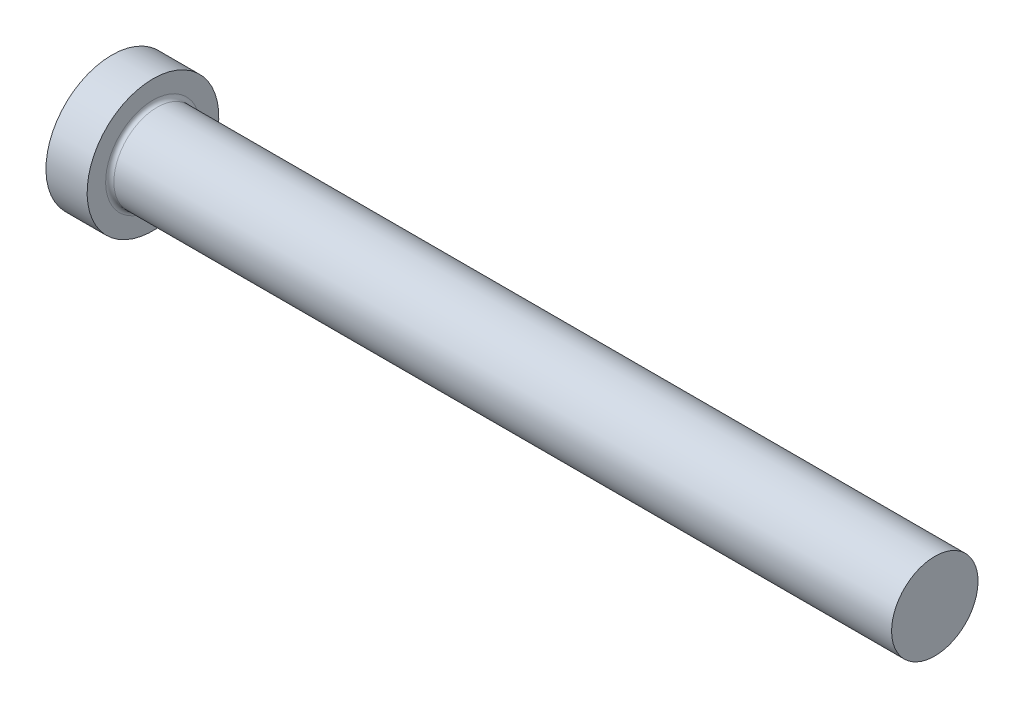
ISO-10303-21;
HEADER;
FILE_DESCRIPTION(('STEP AP214'),'2;1');
FILE_NAME('part.step','',(''),(''),'','','');
FILE_SCHEMA(('AUTOMOTIVE_DESIGN { 1 0 10303 214 1 1 1 1 }'));
ENDSEC;
DATA;
#1=APPLICATION_CONTEXT('core data for automotive mechanical design processes');
#2=APPLICATION_PROTOCOL_DEFINITION('international standard','automotive_design',2000,#1);
#3=PRODUCT_CONTEXT('',#1,'mechanical');
#4=PRODUCT('Part','Part','',(#3));
#5=PRODUCT_RELATED_PRODUCT_CATEGORY('part','',(#4));
#6=PRODUCT_DEFINITION_FORMATION('','',#4);
#7=PRODUCT_DEFINITION_CONTEXT('part definition',#1,'design');
#8=PRODUCT_DEFINITION('design','',#6,#7);
#9=PRODUCT_DEFINITION_SHAPE('','',#8);
#10=(LENGTH_UNIT() NAMED_UNIT(*) SI_UNIT(.MILLI.,.METRE.));
#11=(NAMED_UNIT(*) PLANE_ANGLE_UNIT() SI_UNIT($,.RADIAN.));
#12=(NAMED_UNIT(*) SI_UNIT($,.STERADIAN.) SOLID_ANGLE_UNIT());
#13=UNCERTAINTY_MEASURE_WITH_UNIT(LENGTH_MEASURE(1.E-05),#10,'distance_accuracy_value','');
#14=(GEOMETRIC_REPRESENTATION_CONTEXT(3) GLOBAL_UNCERTAINTY_ASSIGNED_CONTEXT((#13)) GLOBAL_UNIT_ASSIGNED_CONTEXT((#10,
#11,#12)) REPRESENTATION_CONTEXT('',''));
#15=CARTESIAN_POINT('',(0.,0.,0.));
#16=DIRECTION('',(0.,0.,1.));
#17=DIRECTION('',(1.,0.,0.));
#18=AXIS2_PLACEMENT_3D('',#15,#16,#17);
#19=CARTESIAN_POINT('',(0.,0.,0.));
#20=DIRECTION('',(-1.,0.,0.));
#21=DIRECTION('',(0.,-1.,0.));
#22=AXIS2_PLACEMENT_3D('',#19,#20,#21);
#23=PLANE('',#22);
#24=CARTESIAN_POINT('',(0.,0.,0.));
#25=DIRECTION('',(1.,0.,0.));
#26=DIRECTION('',(0.,1.,0.));
#27=AXIS2_PLACEMENT_3D('',#24,#25,#26);
#28=CIRCLE('',#27,8.);
#29=CARTESIAN_POINT('',(0.,8.,0.));
#30=VERTEX_POINT('',#29);
#31=EDGE_CURVE('E24',#30,#30,#28,.T.);
#32=ORIENTED_EDGE('',*,*,#31,.F.);
#33=EDGE_LOOP('',(#32));
#34=FACE_BOUND('',#33,.T.);
#35=ADVANCED_FACE('F13',(#34),#23,.T.);
#36=CARTESIAN_POINT('',(100.,0.,0.));
#37=DIRECTION('',(1.,0.,0.));
#38=DIRECTION('',(0.,1.,0.));
#39=AXIS2_PLACEMENT_3D('',#36,#37,#38);
#40=CYLINDRICAL_SURFACE('',#39,8.);
#41=ORIENTED_EDGE('',*,*,#31,.T.);
#42=EDGE_LOOP('',(#41));
#43=FACE_BOUND('',#42,.T.);
#44=CARTESIAN_POINT('',(5.,0.,0.));
#45=DIRECTION('',(1.,0.,0.));
#46=DIRECTION('',(0.,1.,0.));
#47=AXIS2_PLACEMENT_3D('',#44,#45,#46);
#48=CIRCLE('',#47,8.);
#49=CARTESIAN_POINT('',(5.00000000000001,8.,0.));
#50=VERTEX_POINT('',#49);
#51=EDGE_CURVE('E28',#50,#50,#48,.T.);
#52=ORIENTED_EDGE('',*,*,#51,.F.);
#53=EDGE_LOOP('',(#52));
#54=FACE_BOUND('',#53,.T.);
#55=ADVANCED_FACE('F50',(#43,#54),#40,.T.);
#56=CARTESIAN_POINT('',(5.,8.,0.));
#57=DIRECTION('',(1.,0.,0.));
#58=DIRECTION('',(0.,1.,0.));
#59=AXIS2_PLACEMENT_3D('',#56,#57,#58);
#60=PLANE('',#59);
#61=CARTESIAN_POINT('',(5.,0.,0.));
#62=DIRECTION('',(1.,0.,0.));
#63=DIRECTION('',(0.,1.,0.));
#64=AXIS2_PLACEMENT_3D('',#61,#62,#63);
#65=CIRCLE('',#64,5.75);
#66=CARTESIAN_POINT('',(5.,5.75,0.));
#67=VERTEX_POINT('',#66);
#68=EDGE_CURVE('E8',#67,#67,#65,.F.);
#69=ORIENTED_EDGE('',*,*,#68,.T.);
#70=EDGE_LOOP('',(#69));
#71=FACE_BOUND('',#70,.T.);
#72=ORIENTED_EDGE('',*,*,#51,.T.);
#73=EDGE_LOOP('',(#72));
#74=FACE_BOUND('',#73,.T.);
#75=ADVANCED_FACE('F41',(#71,#74),#60,.T.);
#76=CARTESIAN_POINT('',(100.,0.,0.));
#77=DIRECTION('',(1.,0.,0.));
#78=DIRECTION('',(0.,1.,0.));
#79=AXIS2_PLACEMENT_3D('',#76,#77,#78);
#80=CYLINDRICAL_SURFACE('',#79,5.25);
#81=CARTESIAN_POINT('',(5.5,0.,0.));
#82=DIRECTION('',(1.,0.,0.));
#83=DIRECTION('',(0.,1.,0.));
#84=AXIS2_PLACEMENT_3D('',#81,#82,#83);
#85=CIRCLE('',#84,5.25);
#86=CARTESIAN_POINT('',(5.5,5.25,0.));
#87=VERTEX_POINT('',#86);
#88=EDGE_CURVE('E20',#87,#87,#85,.T.);
#89=ORIENTED_EDGE('',*,*,#88,.T.);
#90=EDGE_LOOP('',(#89));
#91=FACE_BOUND('',#90,.T.);
#92=CARTESIAN_POINT('',(100.,0.,0.));
#93=DIRECTION('',(1.,0.,0.));
#94=DIRECTION('',(0.,1.,0.));
#95=AXIS2_PLACEMENT_3D('',#92,#93,#94);
#96=CIRCLE('',#95,5.25);
#97=CARTESIAN_POINT('',(100.,5.24999999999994,0.));
#98=VERTEX_POINT('',#97);
#99=EDGE_CURVE('E33',#98,#98,#96,.T.);
#100=ORIENTED_EDGE('',*,*,#99,.F.);
#101=EDGE_LOOP('',(#100));
#102=FACE_BOUND('',#101,.T.);
#103=ADVANCED_FACE('F39',(#91,#102),#80,.T.);
#104=CARTESIAN_POINT('',(100.,5.24999999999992,0.));
#105=DIRECTION('',(1.,0.,0.));
#106=DIRECTION('',(0.,1.,0.));
#107=AXIS2_PLACEMENT_3D('',#104,#105,#106);
#108=PLANE('',#107);
#109=ORIENTED_EDGE('',*,*,#99,.T.);
#110=EDGE_LOOP('',(#109));
#111=FACE_BOUND('',#110,.T.);
#112=ADVANCED_FACE('F37',(#111),#108,.T.);
#113=CARTESIAN_POINT('',(5.5,0.,0.));
#114=DIRECTION('',(1.,0.,0.));
#115=DIRECTION('',(0.,1.,0.));
#116=AXIS2_PLACEMENT_3D('',#113,#114,#115);
#117=TOROIDAL_SURFACE('',#116,5.75,0.5);
#118=ORIENTED_EDGE('',*,*,#68,.F.);
#119=EDGE_LOOP('',(#118));
#120=FACE_BOUND('',#119,.T.);
#121=ORIENTED_EDGE('',*,*,#88,.F.);
#122=EDGE_LOOP('',(#121));
#123=FACE_BOUND('',#122,.T.);
#124=ADVANCED_FACE('F15',(#120,#123),#117,.F.);
#125=CLOSED_SHELL('',(#35,#55,#75,#103,#112,#124));
#126=MANIFOLD_SOLID_BREP('B1',#125);
#127=ADVANCED_BREP_SHAPE_REPRESENTATION('',(#18,#126),#14);
#128=SHAPE_DEFINITION_REPRESENTATION(#9,#127);
ENDSEC;
END-ISO-10303-21;
